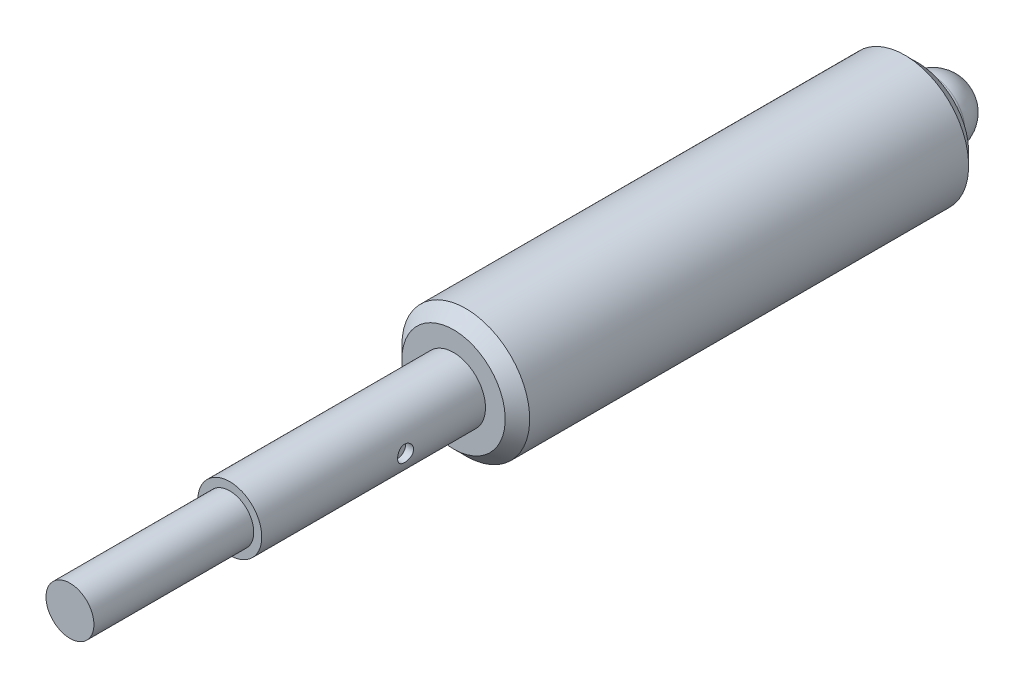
ISO-10303-21;
HEADER;
FILE_DESCRIPTION(('STEP AP214'),'2;1');
FILE_NAME('part.step','',(''),(''),'','','');
FILE_SCHEMA(('AUTOMOTIVE_DESIGN { 1 0 10303 214 1 1 1 1 }'));
ENDSEC;
DATA;
#1=APPLICATION_CONTEXT('core data for automotive mechanical design processes');
#2=APPLICATION_PROTOCOL_DEFINITION('international standard','automotive_design',2000,#1);
#3=PRODUCT_CONTEXT('',#1,'mechanical');
#4=PRODUCT('Part','Part','',(#3));
#5=PRODUCT_RELATED_PRODUCT_CATEGORY('part','',(#4));
#6=PRODUCT_DEFINITION_FORMATION('','',#4);
#7=PRODUCT_DEFINITION_CONTEXT('part definition',#1,'design');
#8=PRODUCT_DEFINITION('design','',#6,#7);
#9=PRODUCT_DEFINITION_SHAPE('','',#8);
#10=(LENGTH_UNIT() NAMED_UNIT(*) SI_UNIT(.MILLI.,.METRE.));
#11=(NAMED_UNIT(*) PLANE_ANGLE_UNIT() SI_UNIT($,.RADIAN.));
#12=(NAMED_UNIT(*) SI_UNIT($,.STERADIAN.) SOLID_ANGLE_UNIT());
#13=UNCERTAINTY_MEASURE_WITH_UNIT(LENGTH_MEASURE(1.E-05),#10,'distance_accuracy_value','');
#14=(GEOMETRIC_REPRESENTATION_CONTEXT(3) GLOBAL_UNCERTAINTY_ASSIGNED_CONTEXT((#13)) GLOBAL_UNIT_ASSIGNED_CONTEXT((#10,
#11,#12)) REPRESENTATION_CONTEXT('',''));
#15=CARTESIAN_POINT('',(0.,0.,0.));
#16=DIRECTION('',(0.,0.,1.));
#17=DIRECTION('',(1.,0.,0.));
#18=AXIS2_PLACEMENT_3D('',#15,#16,#17);
#19=CARTESIAN_POINT('',(0.,0.,53.));
#20=DIRECTION('',(0.,0.,-1.));
#21=DIRECTION('',(-1.,0.,0.));
#22=AXIS2_PLACEMENT_3D('',#19,#20,#21);
#23=PLANE('',#22);
#24=CARTESIAN_POINT('',(0.,0.,53.));
#25=DIRECTION('',(0.,0.,-1.));
#26=DIRECTION('',(-1.,0.,0.));
#27=AXIS2_PLACEMENT_3D('',#24,#25,#26);
#28=CIRCLE('',#27,1.5);
#29=CARTESIAN_POINT('',(-1.5,0.,53.));
#30=VERTEX_POINT('',#29);
#31=EDGE_CURVE('E25',#30,#30,#28,.T.);
#32=ORIENTED_EDGE('',*,*,#31,.F.);
#33=EDGE_LOOP('',(#32));
#34=FACE_BOUND('',#33,.T.);
#35=ADVANCED_FACE('F13',(#34),#23,.F.);
#36=CARTESIAN_POINT('',(0.,0.,5.));
#37=DIRECTION('',(0.,0.,-1.));
#38=DIRECTION('',(-1.,0.,0.));
#39=AXIS2_PLACEMENT_3D('',#36,#37,#38);
#40=CYLINDRICAL_SURFACE('',#39,1.5);
#41=CARTESIAN_POINT('',(0.,0.,43.));
#42=DIRECTION('',(0.,0.,-1.));
#43=DIRECTION('',(-1.,0.,0.));
#44=AXIS2_PLACEMENT_3D('',#41,#42,#43);
#45=CIRCLE('',#44,1.5);
#46=CARTESIAN_POINT('',(-1.5,0.,43.));
#47=VERTEX_POINT('',#46);
#48=EDGE_CURVE('E29',#47,#47,#45,.T.);
#49=ORIENTED_EDGE('',*,*,#48,.F.);
#50=EDGE_LOOP('',(#49));
#51=FACE_BOUND('',#50,.T.);
#52=ORIENTED_EDGE('',*,*,#31,.T.);
#53=EDGE_LOOP('',(#52));
#54=FACE_BOUND('',#53,.T.);
#55=ADVANCED_FACE('F86',(#51,#54),#40,.T.);
#56=CARTESIAN_POINT('',(0.,1.5,43.));
#57=DIRECTION('',(0.,0.,-1.));
#58=DIRECTION('',(-1.,0.,0.));
#59=AXIS2_PLACEMENT_3D('',#56,#57,#58);
#60=PLANE('',#59);
#61=CARTESIAN_POINT('',(0.,0.,43.));
#62=DIRECTION('',(0.,0.,-1.));
#63=DIRECTION('',(-1.,0.,0.));
#64=AXIS2_PLACEMENT_3D('',#61,#62,#63);
#65=CIRCLE('',#64,2.);
#66=CARTESIAN_POINT('',(-2.,0.,43.));
#67=VERTEX_POINT('',#66);
#68=EDGE_CURVE('E33',#67,#67,#65,.T.);
#69=ORIENTED_EDGE('',*,*,#68,.F.);
#70=EDGE_LOOP('',(#69));
#71=FACE_BOUND('',#70,.T.);
#72=ORIENTED_EDGE('',*,*,#48,.T.);
#73=EDGE_LOOP('',(#72));
#74=FACE_BOUND('',#73,.T.);
#75=ADVANCED_FACE('F91',(#71,#74),#60,.F.);
#76=CARTESIAN_POINT('',(0.,0.,5.));
#77=DIRECTION('',(0.,0.,-1.));
#78=DIRECTION('',(-1.,0.,0.));
#79=AXIS2_PLACEMENT_3D('',#76,#77,#78);
#80=CYLINDRICAL_SURFACE('',#79,2.);
#81=CARTESIAN_POINT('',(0.,0.,29.));
#82=DIRECTION('',(0.,0.,-1.));
#83=DIRECTION('',(-1.,0.,0.));
#84=AXIS2_PLACEMENT_3D('',#81,#82,#83);
#85=CIRCLE('',#84,2.);
#86=CARTESIAN_POINT('',(-2.,0.,29.));
#87=VERTEX_POINT('',#86);
#88=EDGE_CURVE('E38',#87,#87,#85,.T.);
#89=ORIENTED_EDGE('',*,*,#88,.F.);
#90=EDGE_LOOP('',(#89));
#91=FACE_BOUND('',#90,.T.);
#92=CARTESIAN_POINT('',(2.,0.,33.5));
#93=CARTESIAN_POINT('',(1.99999953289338,-0.0276253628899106,33.5000007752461));
#94=CARTESIAN_POINT('',(1.99942192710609,-0.0552593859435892,33.5022971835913));
#95=CARTESIAN_POINT('',(1.99717371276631,-0.109735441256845,33.511408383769));
#96=CARTESIAN_POINT('',(1.99550248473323,-0.136577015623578,33.5182257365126));
#97=CARTESIAN_POINT('',(1.99125208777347,-0.188673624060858,33.5361464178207));
#98=CARTESIAN_POINT('',(1.98867400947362,-0.213930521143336,33.5472445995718));
#99=CARTESIAN_POINT('',(1.98288447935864,-0.262224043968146,33.5733937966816));
#100=CARTESIAN_POINT('',(1.97967300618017,-0.285260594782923,33.588444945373));
#101=CARTESIAN_POINT('',(1.97289137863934,-0.328933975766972,33.6224002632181));
#102=CARTESIAN_POINT('',(1.96931569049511,-0.349518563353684,33.6413705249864));
#103=CARTESIAN_POINT('',(1.96224540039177,-0.387249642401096,33.682484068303));
#104=CARTESIAN_POINT('',(1.95875080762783,-0.404395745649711,33.7046277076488));
#105=CARTESIAN_POINT('',(1.9521825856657,-0.435008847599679,33.7518650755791));
#106=CARTESIAN_POINT('',(1.94911598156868,-0.448417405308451,33.7769977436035));
#107=CARTESIAN_POINT('',(1.94383164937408,-0.470798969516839,33.8292494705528));
#108=CARTESIAN_POINT('',(1.94161378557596,-0.479772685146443,33.8563682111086));
#109=CARTESIAN_POINT('',(1.93833492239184,-0.492851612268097,33.9112478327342));
#110=CARTESIAN_POINT('',(1.93725163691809,-0.497050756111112,33.9389849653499));
#111=CARTESIAN_POINT('',(1.9362978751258,-0.500753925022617,33.9947895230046));
#112=CARTESIAN_POINT('',(1.93642720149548,-0.500258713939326,34.0228568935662));
#113=CARTESIAN_POINT('',(1.93786401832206,-0.49466217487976,34.0778052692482));
#114=CARTESIAN_POINT('',(1.93914287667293,-0.489672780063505,34.1046985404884));
#115=CARTESIAN_POINT('',(1.94268903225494,-0.475408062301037,34.1572536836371));
#116=CARTESIAN_POINT('',(1.94495639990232,-0.466132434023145,34.1829154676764));
#117=CARTESIAN_POINT('',(1.95025037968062,-0.443463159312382,34.2325793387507));
#118=CARTESIAN_POINT('',(1.95328442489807,-0.430028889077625,34.2565620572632));
#119=CARTESIAN_POINT('',(1.95976570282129,-0.399452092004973,34.3019729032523));
#120=CARTESIAN_POINT('',(1.96321300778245,-0.382308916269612,34.3234005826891));
#121=CARTESIAN_POINT('',(1.9702529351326,-0.344221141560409,34.3637345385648));
#122=CARTESIAN_POINT('',(1.97384689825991,-0.323182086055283,34.3825514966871));
#123=CARTESIAN_POINT('',(1.98068655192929,-0.278203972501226,34.4164070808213));
#124=CARTESIAN_POINT('',(1.98393223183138,-0.254264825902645,34.4314455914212));
#125=CARTESIAN_POINT('',(1.98972577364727,-0.204038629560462,34.4573501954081));
#126=CARTESIAN_POINT('',(1.99227120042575,-0.177743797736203,34.4682017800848));
#127=CARTESIAN_POINT('',(1.99635972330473,-0.123625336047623,34.4853057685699));
#128=CARTESIAN_POINT('',(1.99790301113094,-0.0958019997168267,34.4915590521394));
#129=CARTESIAN_POINT('',(1.99978499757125,-0.0401799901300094,34.499152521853));
#130=CARTESIAN_POINT('',(2.00015351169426,-0.0123989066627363,34.5006143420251));
#131=CARTESIAN_POINT('',(1.9997293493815,0.0430109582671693,34.4989169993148));
#132=CARTESIAN_POINT('',(1.99893677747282,0.0706397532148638,34.4957582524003));
#133=CARTESIAN_POINT('',(1.99629860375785,0.124538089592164,34.4850096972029));
#134=CARTESIAN_POINT('',(1.99446878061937,0.150821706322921,34.4774862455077));
#135=CARTESIAN_POINT('',(1.98996235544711,0.201752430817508,34.4582976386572));
#136=CARTESIAN_POINT('',(1.98728566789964,0.226399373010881,34.446632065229));
#137=CARTESIAN_POINT('',(1.98131102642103,0.273841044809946,34.4192546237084));
#138=CARTESIAN_POINT('',(1.97800289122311,0.296595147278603,34.4034746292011));
#139=CARTESIAN_POINT('',(1.97114836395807,0.339175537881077,34.3684033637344));
#140=CARTESIAN_POINT('',(1.96760193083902,0.35900131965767,34.3491114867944));
#141=CARTESIAN_POINT('',(1.96056318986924,0.395663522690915,34.3069993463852));
#142=CARTESIAN_POINT('',(1.95707434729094,0.412414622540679,34.2841040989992));
#143=CARTESIAN_POINT('',(1.95064292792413,0.441836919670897,34.2357557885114));
#144=CARTESIAN_POINT('',(1.94770032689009,0.454508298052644,34.2103028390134));
#145=CARTESIAN_POINT('',(1.94272698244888,0.475317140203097,34.157698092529));
#146=CARTESIAN_POINT('',(1.94069085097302,0.483481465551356,34.1305574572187));
#147=CARTESIAN_POINT('',(1.93775581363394,0.495115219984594,34.0752301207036));
#148=CARTESIAN_POINT('',(1.93685665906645,0.498585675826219,34.0470436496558));
#149=CARTESIAN_POINT('',(1.93631633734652,0.500679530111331,33.9912929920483));
#150=CARTESIAN_POINT('',(1.93663977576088,0.49943929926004,33.9637341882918));
#151=CARTESIAN_POINT('',(1.93842636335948,0.492459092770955,33.9092320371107));
#152=CARTESIAN_POINT('',(1.93988948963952,0.486719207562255,33.8822886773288));
#153=CARTESIAN_POINT('',(1.94377086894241,0.470977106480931,33.8299305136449));
#154=CARTESIAN_POINT('',(1.94618338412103,0.461000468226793,33.8045075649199));
#155=CARTESIAN_POINT('',(1.95169251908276,0.437088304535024,33.7556782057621));
#156=CARTESIAN_POINT('',(1.95478923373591,0.423152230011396,33.7322720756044));
#157=CARTESIAN_POINT('',(1.96141878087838,0.39128924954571,33.6874817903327));
#158=CARTESIAN_POINT('',(1.96496088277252,0.373267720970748,33.6661663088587));
#159=CARTESIAN_POINT('',(1.97202675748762,0.333929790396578,33.6268176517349));
#160=CARTESIAN_POINT('',(1.97555052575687,0.312612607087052,33.608785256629));
#161=CARTESIAN_POINT('',(1.98225885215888,0.266822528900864,33.5761962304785));
#162=CARTESIAN_POINT('',(1.98543611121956,0.242299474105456,33.5617084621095));
#163=CARTESIAN_POINT('',(1.99101641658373,0.191088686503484,33.5370841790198));
#164=CARTESIAN_POINT('',(1.99342001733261,0.164402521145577,33.5269445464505));
#165=CARTESIAN_POINT('',(1.99682686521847,0.114803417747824,33.5128093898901));
#166=CARTESIAN_POINT('',(1.9980086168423,0.0921267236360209,33.5080162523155));
#167=CARTESIAN_POINT('',(1.99959535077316,0.0463020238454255,33.501611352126));
#168=CARTESIAN_POINT('',(2.00000039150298,0.023154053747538,33.4999993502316));
#169=CARTESIAN_POINT('',(2.,0.,33.5));
#170=B_SPLINE_CURVE_WITH_KNOTS('',3,(#92,#93,#94,#95,#96,#97,#98,#99,#100,#101,#102,#103,#104,
#105,#106,#107,#108,#109,#110,#111,#112,#113,#114,#115,#116,#117,#118,#119,#120,#121,#122,#123,
#124,#125,#126,#127,#128,#129,#130,#131,#132,#133,#134,#135,#136,#137,#138,#139,#140,#141,#142,
#143,#144,#145,#146,#147,#148,#149,#150,#151,#152,#153,#154,#155,#156,#157,#158,#159,#160,#161,
#162,#163,#164,#165,#166,#167,#168,#169),.UNSPECIFIED.,.T.,.F.,(4,2,2,2,2,2,2,2,2,2,2,2,2,2,2,2,
2,2,2,2,2,2,2,2,2,2,2,2,2,2,2,2,2,2,2,2,2,2,4),(0.,0.0827912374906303,0.165629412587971,
0.248368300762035,0.331109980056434,0.415381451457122,0.499662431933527,0.585195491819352,
0.67071487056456,0.754520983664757,0.838313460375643,0.920074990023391,1.00184234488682,
1.08443509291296,1.16704230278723,1.25200500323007,1.33697029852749,1.42222743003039,
1.50746824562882,1.59052769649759,1.67357967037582,1.7554009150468,1.83723042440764,
1.92051195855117,2.00380787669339,2.08914836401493,2.17448506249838,2.25930751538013,
2.34411141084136,2.42647926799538,2.50884546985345,2.59072133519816,2.67260856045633,
2.75663192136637,2.84067523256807,2.92624061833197,3.01174454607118,3.08114080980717,
3.1505318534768),.UNSPECIFIED.);
#171=CARTESIAN_POINT('',(2.,0.,33.5));
#172=VERTEX_POINT('',#171);
#173=EDGE_CURVE('E8',#172,#172,#170,.T.);
#174=ORIENTED_EDGE('',*,*,#173,.T.);
#175=EDGE_LOOP('',(#174));
#176=FACE_BOUND('',#175,.T.);
#177=ORIENTED_EDGE('',*,*,#68,.T.);
#178=EDGE_LOOP('',(#177));
#179=FACE_BOUND('',#178,.T.);
#180=ADVANCED_FACE('F96',(#91,#176,#179),#80,.T.);
#181=CARTESIAN_POINT('',(0.,2.,29.));
#182=DIRECTION('',(0.,0.,-1.));
#183=DIRECTION('',(-1.,0.,0.));
#184=AXIS2_PLACEMENT_3D('',#181,#182,#183);
#185=PLANE('',#184);
#186=CARTESIAN_POINT('',(0.,0.,29.));
#187=DIRECTION('',(0.,0.,-1.));
#188=DIRECTION('',(-1.,0.,0.));
#189=AXIS2_PLACEMENT_3D('',#186,#187,#188);
#190=CIRCLE('',#189,3.233);
#191=CARTESIAN_POINT('',(-3.233,0.,29.));
#192=VERTEX_POINT('',#191);
#193=EDGE_CURVE('E41',#192,#192,#190,.T.);
#194=ORIENTED_EDGE('',*,*,#193,.F.);
#195=EDGE_LOOP('',(#194));
#196=FACE_BOUND('',#195,.T.);
#197=ORIENTED_EDGE('',*,*,#88,.T.);
#198=EDGE_LOOP('',(#197));
#199=FACE_BOUND('',#198,.T.);
#200=ADVANCED_FACE('F103',(#196,#199),#185,.F.);
#201=CARTESIAN_POINT('',(0.,0.,29.));
#202=DIRECTION('',(0.,0.,-1.));
#203=DIRECTION('',(-1.,0.,0.));
#204=AXIS2_PLACEMENT_3D('',#201,#202,#203);
#205=CONICAL_SURFACE('',#204,3.233,0.785398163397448);
#206=CARTESIAN_POINT('',(0.,0.,28.233));
#207=DIRECTION('',(0.,0.,-1.));
#208=DIRECTION('',(-1.,0.,0.));
#209=AXIS2_PLACEMENT_3D('',#206,#207,#208);
#210=CIRCLE('',#209,4.);
#211=CARTESIAN_POINT('',(-4.,0.,28.233));
#212=VERTEX_POINT('',#211);
#213=EDGE_CURVE('E44',#212,#212,#210,.T.);
#214=ORIENTED_EDGE('',*,*,#213,.F.);
#215=EDGE_LOOP('',(#214));
#216=FACE_BOUND('',#215,.T.);
#217=ORIENTED_EDGE('',*,*,#193,.T.);
#218=EDGE_LOOP('',(#217));
#219=FACE_BOUND('',#218,.T.);
#220=ADVANCED_FACE('F107',(#216,#219),#205,.T.);
#221=CARTESIAN_POINT('',(0.,0.,5.));
#222=DIRECTION('',(0.,0.,-1.));
#223=DIRECTION('',(-1.,0.,0.));
#224=AXIS2_PLACEMENT_3D('',#221,#222,#223);
#225=CYLINDRICAL_SURFACE('',#224,4.);
#226=CARTESIAN_POINT('',(0.,0.,0.767));
#227=DIRECTION('',(0.,0.,-1.));
#228=DIRECTION('',(-1.,0.,0.));
#229=AXIS2_PLACEMENT_3D('',#226,#227,#228);
#230=CIRCLE('',#229,4.);
#231=CARTESIAN_POINT('',(-4.,0.,0.767));
#232=VERTEX_POINT('',#231);
#233=EDGE_CURVE('E47',#232,#232,#230,.T.);
#234=ORIENTED_EDGE('',*,*,#233,.F.);
#235=EDGE_LOOP('',(#234));
#236=FACE_BOUND('',#235,.T.);
#237=ORIENTED_EDGE('',*,*,#213,.T.);
#238=EDGE_LOOP('',(#237));
#239=FACE_BOUND('',#238,.T.);
#240=ADVANCED_FACE('F111',(#236,#239),#225,.T.);
#241=CARTESIAN_POINT('',(0.,0.,0.767));
#242=DIRECTION('',(0.,0.,1.));
#243=DIRECTION('',(1.,0.,0.));
#244=AXIS2_PLACEMENT_3D('',#241,#242,#243);
#245=CONICAL_SURFACE('',#244,4.,0.785398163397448);
#246=CARTESIAN_POINT('',(0.,0.,0.));
#247=DIRECTION('',(0.,0.,-1.));
#248=DIRECTION('',(-1.,0.,0.));
#249=AXIS2_PLACEMENT_3D('',#246,#247,#248);
#250=CIRCLE('',#249,3.233);
#251=CARTESIAN_POINT('',(-3.233,0.,0.));
#252=VERTEX_POINT('',#251);
#253=EDGE_CURVE('E50',#252,#252,#250,.T.);
#254=ORIENTED_EDGE('',*,*,#253,.F.);
#255=EDGE_LOOP('',(#254));
#256=FACE_BOUND('',#255,.T.);
#257=ORIENTED_EDGE('',*,*,#233,.T.);
#258=EDGE_LOOP('',(#257));
#259=FACE_BOUND('',#258,.T.);
#260=ADVANCED_FACE('F115',(#256,#259),#245,.T.);
#261=CARTESIAN_POINT('',(0.,3.233,0.));
#262=DIRECTION('',(0.,0.,1.));
#263=DIRECTION('',(1.,0.,0.));
#264=AXIS2_PLACEMENT_3D('',#261,#262,#263);
#265=PLANE('',#264);
#266=CARTESIAN_POINT('',(0.,0.,0.));
#267=DIRECTION('',(0.,0.,-1.));
#268=DIRECTION('',(-1.,0.,0.));
#269=AXIS2_PLACEMENT_3D('',#266,#267,#268);
#270=CIRCLE('',#269,2.);
#271=CARTESIAN_POINT('',(-2.,0.,0.));
#272=VERTEX_POINT('',#271);
#273=EDGE_CURVE('E53',#272,#272,#270,.T.);
#274=ORIENTED_EDGE('',*,*,#273,.F.);
#275=EDGE_LOOP('',(#274));
#276=FACE_BOUND('',#275,.T.);
#277=ORIENTED_EDGE('',*,*,#253,.T.);
#278=EDGE_LOOP('',(#277));
#279=FACE_BOUND('',#278,.T.);
#280=ADVANCED_FACE('F119',(#276,#279),#265,.F.);
#281=CARTESIAN_POINT('',(0.,0.,-3.));
#282=DIRECTION('',(0.,0.,-1.));
#283=DIRECTION('',(-1.,0.,0.));
#284=AXIS2_PLACEMENT_3D('',#281,#282,#283);
#285=CYLINDRICAL_SURFACE('',#284,2.);
#286=CARTESIAN_POINT('',(0.,0.,-1.));
#287=DIRECTION('',(0.,0.,-1.));
#288=DIRECTION('',(-1.,0.,0.));
#289=AXIS2_PLACEMENT_3D('',#286,#287,#288);
#290=CIRCLE('',#289,2.);
#291=CARTESIAN_POINT('',(-2.,0.,-1.));
#292=VERTEX_POINT('',#291);
#293=EDGE_CURVE('E62',#292,#292,#290,.T.);
#294=ORIENTED_EDGE('',*,*,#293,.F.);
#295=EDGE_LOOP('',(#294));
#296=FACE_BOUND('',#295,.T.);
#297=ORIENTED_EDGE('',*,*,#273,.T.);
#298=EDGE_LOOP('',(#297));
#299=FACE_BOUND('',#298,.T.);
#300=ADVANCED_FACE('F81',(#296,#299),#285,.T.);
#301=CARTESIAN_POINT('',(0.,0.,-1.));
#302=DIRECTION('',(0.,0.,-1.));
#303=DIRECTION('',(0.,1.,0.));
#304=AXIS2_PLACEMENT_3D('',#301,#302,#303);
#305=SPHERICAL_SURFACE('',#304,2.);
#306=ORIENTED_EDGE('',*,*,#293,.T.);
#307=EDGE_LOOP('',(#306));
#308=FACE_BOUND('',#307,.T.);
#309=ADVANCED_FACE('F74',(#308),#305,.T.);
#310=CARTESIAN_POINT('',(1.5,0.,34.));
#311=DIRECTION('',(1.,0.,0.));
#312=DIRECTION('',(0.,0.,-1.));
#313=AXIS2_PLACEMENT_3D('',#310,#311,#312);
#314=CYLINDRICAL_SURFACE('',#313,0.5);
#315=CARTESIAN_POINT('',(1.5,0.,34.));
#316=DIRECTION('',(1.,0.,0.));
#317=DIRECTION('',(0.,0.,-1.));
#318=AXIS2_PLACEMENT_3D('',#315,#316,#317);
#319=CIRCLE('',#318,0.5);
#320=CARTESIAN_POINT('',(1.5,0.,33.5));
#321=VERTEX_POINT('',#320);
#322=EDGE_CURVE('E65',#321,#321,#319,.T.);
#323=ORIENTED_EDGE('',*,*,#322,.F.);
#324=EDGE_LOOP('',(#323));
#325=FACE_BOUND('',#324,.T.);
#326=ORIENTED_EDGE('',*,*,#173,.F.);
#327=EDGE_LOOP('',(#326));
#328=FACE_BOUND('',#327,.T.);
#329=ADVANCED_FACE('F71',(#325,#328),#314,.F.);
#330=CARTESIAN_POINT('',(1.5,0.,34.));
#331=DIRECTION('',(1.,0.,0.));
#332=DIRECTION('',(0.,0.,-1.));
#333=AXIS2_PLACEMENT_3D('',#330,#331,#332);
#334=PLANE('',#333);
#335=ORIENTED_EDGE('',*,*,#322,.T.);
#336=EDGE_LOOP('',(#335));
#337=FACE_BOUND('',#336,.T.);
#338=ADVANCED_FACE('F69',(#337),#334,.T.);
#339=CLOSED_SHELL('',(#35,#55,#75,#180,#200,#220,#240,#260,#280,#300,#309,#329,#338));
#340=CARTESIAN_POINT('',(0.,0.,4.));
#341=DIRECTION('',(0.,0.,-1.));
#342=DIRECTION('',(-1.,0.,0.));
#343=AXIS2_PLACEMENT_3D('',#340,#341,#342);
#344=PLANE('',#343);
#345=CARTESIAN_POINT('',(0.,0.,4.));
#346=DIRECTION('',(0.,0.,-1.));
#347=DIRECTION('',(-1.,0.,0.));
#348=AXIS2_PLACEMENT_3D('',#345,#346,#347);
#349=CIRCLE('',#348,2.);
#350=CARTESIAN_POINT('',(-2.,0.,4.));
#351=VERTEX_POINT('',#350);
#352=EDGE_CURVE('E59',#351,#351,#349,.T.);
#353=ORIENTED_EDGE('',*,*,#352,.F.);
#354=EDGE_LOOP('',(#353));
#355=FACE_BOUND('',#354,.T.);
#356=ADVANCED_FACE('F132',(#355),#344,.F.);
#357=CARTESIAN_POINT('',(0.,2.,5.));
#358=DIRECTION('',(0.,0.,1.));
#359=DIRECTION('',(1.,0.,0.));
#360=AXIS2_PLACEMENT_3D('',#357,#358,#359);
#361=PLANE('',#360);
#362=CARTESIAN_POINT('',(0.,0.,5.));
#363=DIRECTION('',(0.,0.,-1.));
#364=DIRECTION('',(-1.,0.,0.));
#365=AXIS2_PLACEMENT_3D('',#362,#363,#364);
#366=CIRCLE('',#365,2.);
#367=CARTESIAN_POINT('',(-2.,0.,5.));
#368=VERTEX_POINT('',#367);
#369=EDGE_CURVE('E56',#368,#368,#366,.T.);
#370=ORIENTED_EDGE('',*,*,#369,.T.);
#371=EDGE_LOOP('',(#370));
#372=FACE_BOUND('',#371,.T.);
#373=ADVANCED_FACE('F127',(#372),#361,.F.);
#374=CARTESIAN_POINT('',(0.,0.,5.));
#375=DIRECTION('',(0.,0.,-1.));
#376=DIRECTION('',(-1.,0.,0.));
#377=AXIS2_PLACEMENT_3D('',#374,#375,#376);
#378=CYLINDRICAL_SURFACE('',#377,2.);
#379=ORIENTED_EDGE('',*,*,#369,.F.);
#380=EDGE_LOOP('',(#379));
#381=FACE_BOUND('',#380,.T.);
#382=ORIENTED_EDGE('',*,*,#352,.T.);
#383=EDGE_LOOP('',(#382));
#384=FACE_BOUND('',#383,.T.);
#385=ADVANCED_FACE('F124',(#381,#384),#378,.F.);
#386=CLOSED_SHELL('',(#356,#373,#385));
#387=ORIENTED_CLOSED_SHELL('',*,#386,.T.);
#388=BREP_WITH_VOIDS('B1',#339,(#387));
#389=ADVANCED_BREP_SHAPE_REPRESENTATION('',(#18,#388),#14);
#390=SHAPE_DEFINITION_REPRESENTATION(#9,#389);
ENDSEC;
END-ISO-10303-21;
